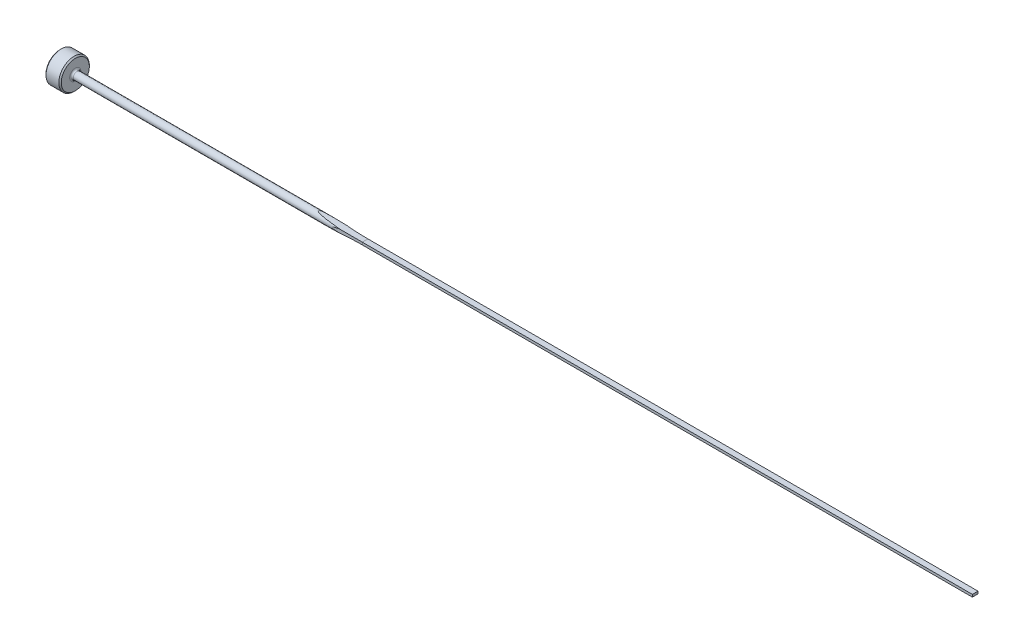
ISO-10303-21;
HEADER;
FILE_DESCRIPTION(('STEP AP214'),'2;1');
FILE_NAME('part.step','',(''),(''),'','','');
FILE_SCHEMA(('AUTOMOTIVE_DESIGN { 1 0 10303 214 1 1 1 1 }'));
ENDSEC;
DATA;
#1=APPLICATION_CONTEXT('core data for automotive mechanical design processes');
#2=APPLICATION_PROTOCOL_DEFINITION('international standard','automotive_design',2000,#1);
#3=PRODUCT_CONTEXT('',#1,'mechanical');
#4=PRODUCT('Part','Part','',(#3));
#5=PRODUCT_RELATED_PRODUCT_CATEGORY('part','',(#4));
#6=PRODUCT_DEFINITION_FORMATION('','',#4);
#7=PRODUCT_DEFINITION_CONTEXT('part definition',#1,'design');
#8=PRODUCT_DEFINITION('design','',#6,#7);
#9=PRODUCT_DEFINITION_SHAPE('','',#8);
#10=(LENGTH_UNIT() NAMED_UNIT(*) SI_UNIT(.MILLI.,.METRE.));
#11=(NAMED_UNIT(*) PLANE_ANGLE_UNIT() SI_UNIT($,.RADIAN.));
#12=(NAMED_UNIT(*) SI_UNIT($,.STERADIAN.) SOLID_ANGLE_UNIT());
#13=UNCERTAINTY_MEASURE_WITH_UNIT(LENGTH_MEASURE(1.E-05),#10,'distance_accuracy_value','');
#14=(GEOMETRIC_REPRESENTATION_CONTEXT(3) GLOBAL_UNCERTAINTY_ASSIGNED_CONTEXT((#13)) GLOBAL_UNIT_ASSIGNED_CONTEXT((#10,
#11,#12)) REPRESENTATION_CONTEXT('',''));
#15=CARTESIAN_POINT('',(0.,0.,0.));
#16=DIRECTION('',(0.,0.,1.));
#17=DIRECTION('',(1.,0.,0.));
#18=AXIS2_PLACEMENT_3D('',#15,#16,#17);
#19=CARTESIAN_POINT('',(0.,0.,0.));
#20=DIRECTION('',(-1.,0.,0.));
#21=DIRECTION('',(0.,0.,1.));
#22=AXIS2_PLACEMENT_3D('',#19,#20,#21);
#23=CYLINDRICAL_SURFACE('',#22,0.79375);
#24=CARTESIAN_POINT('',(3.556,0.,0.));
#25=DIRECTION('',(-1.,0.,0.));
#26=DIRECTION('',(0.,0.,1.));
#27=AXIS2_PLACEMENT_3D('',#24,#25,#26);
#28=CIRCLE('',#27,0.79375);
#29=CARTESIAN_POINT('',(3.556,0.,0.79375));
#30=VERTEX_POINT('',#29);
#31=EDGE_CURVE('E152',#30,#30,#28,.F.);
#32=ORIENTED_EDGE('',*,*,#31,.T.);
#33=EDGE_LOOP('',(#32));
#34=FACE_BOUND('',#33,.T.);
#35=CARTESIAN_POINT('',(63.5,0.537354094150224,0.584199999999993));
#36=CARTESIAN_POINT('',(63.3677986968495,0.537352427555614,0.584199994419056));
#37=CARTESIAN_POINT('',(63.2355977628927,0.537033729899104,0.584494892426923));
#38=CARTESIAN_POINT('',(62.9711986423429,0.535747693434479,0.585674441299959));
#39=CARTESIAN_POINT('',(62.8390004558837,0.534780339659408,0.586559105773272));
#40=CARTESIAN_POINT('',(62.4420069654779,0.53087936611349,0.590101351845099));
#41=CARTESIAN_POINT('',(62.1772280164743,0.526946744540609,0.593647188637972));
#42=CARTESIAN_POINT('',(61.6475584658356,0.516094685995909,0.603107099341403));
#43=CARTESIAN_POINT('',(61.3826679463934,0.509172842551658,0.609023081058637));
#44=CARTESIAN_POINT('',(60.8530338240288,0.491693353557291,0.623220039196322));
#45=CARTESIAN_POINT('',(60.58829024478,0.481135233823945,0.631501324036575));
#46=CARTESIAN_POINT('',(60.0594832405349,0.455276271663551,0.650407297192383));
#47=CARTESIAN_POINT('',(59.7954193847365,0.439982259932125,0.661028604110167));
#48=CARTESIAN_POINT('',(59.39981069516,0.411723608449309,0.678705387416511));
#49=CARTESIAN_POINT('',(59.2680369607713,0.401419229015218,0.684887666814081));
#50=CARTESIAN_POINT('',(59.004722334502,0.378486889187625,0.697828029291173));
#51=CARTESIAN_POINT('',(58.8731814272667,0.36585908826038,0.704586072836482));
#52=CARTESIAN_POINT('',(58.6761769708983,0.344482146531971,0.715145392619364));
#53=CARTESIAN_POINT('',(58.6105699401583,0.33695195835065,0.71873496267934));
#54=CARTESIAN_POINT('',(58.4794798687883,0.320881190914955,0.726052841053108));
#55=CARTESIAN_POINT('',(58.4139968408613,0.312340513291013,0.729781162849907));
#56=CARTESIAN_POINT('',(58.2830735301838,0.293954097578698,0.737380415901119));
#57=CARTESIAN_POINT('',(58.2176336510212,0.284105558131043,0.741251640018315));
#58=CARTESIAN_POINT('',(58.0870608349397,0.262655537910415,0.749120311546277));
#59=CARTESIAN_POINT('',(58.0219278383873,0.25105441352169,0.753117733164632));
#60=CARTESIAN_POINT('',(57.8919403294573,0.22526665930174,0.761238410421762));
#61=CARTESIAN_POINT('',(57.8270873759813,0.211071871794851,0.765362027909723));
#62=CARTESIAN_POINT('',(57.7307839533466,0.1864338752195,0.771589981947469));
#63=CARTESIAN_POINT('',(57.6989102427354,0.177685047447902,0.773668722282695));
#64=CARTESIAN_POINT('',(57.6356848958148,0.158500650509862,0.777825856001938));
#65=CARTESIAN_POINT('',(57.6043331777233,0.14806534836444,0.779904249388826));
#66=CARTESIAN_POINT('',(57.5449685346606,0.12536357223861,0.783870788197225));
#67=CARTESIAN_POINT('',(57.5168860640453,0.113303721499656,0.785761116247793));
#68=CARTESIAN_POINT('',(57.4787827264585,0.0926836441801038,0.788342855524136));
#69=CARTESIAN_POINT('',(57.4676987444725,0.0861257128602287,0.789096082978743));
#70=CARTESIAN_POINT('',(57.4464596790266,0.0716589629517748,0.790543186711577));
#71=CARTESIAN_POINT('',(57.4362989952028,0.0637592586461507,0.791237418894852));
#72=CARTESIAN_POINT('',(57.4241935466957,0.0517558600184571,0.792066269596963));
#73=CARTESIAN_POINT('',(57.4212914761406,0.0486376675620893,0.792265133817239));
#74=CARTESIAN_POINT('',(57.4158307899,0.0421001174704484,0.792639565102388));
#75=CARTESIAN_POINT('',(57.4132726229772,0.0386803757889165,0.792815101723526));
#76=CARTESIAN_POINT('',(57.4086203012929,0.0314630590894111,0.793134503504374));
#77=CARTESIAN_POINT('',(57.4065328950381,0.0276609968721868,0.793277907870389));
#78=CARTESIAN_POINT('',(57.4030925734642,0.0197374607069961,0.793514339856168));
#79=CARTESIAN_POINT('',(57.4017370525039,0.0156171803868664,0.793607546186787));
#80=CARTESIAN_POINT('',(57.4002141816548,0.00832744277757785,0.793712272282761));
#81=CARTESIAN_POINT('',(57.3998236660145,0.00520497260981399,0.793739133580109));
#82=CARTESIAN_POINT('',(57.3995863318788,-0.0010609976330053,0.793755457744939));
#83=CARTESIAN_POINT('',(57.3997393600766,-0.00420449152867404,0.793744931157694));
#84=CARTESIAN_POINT('',(57.4005699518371,-0.0104090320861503,0.793687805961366));
#85=CARTESIAN_POINT('',(57.4012458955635,-0.013470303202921,0.793641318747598));
#86=CARTESIAN_POINT('',(57.4030509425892,-0.0194544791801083,0.793517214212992));
#87=CARTESIAN_POINT('',(57.4041804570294,-0.0223772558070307,0.79343956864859));
#88=CARTESIAN_POINT('',(57.4075834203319,-0.0297362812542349,0.793205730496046));
#89=CARTESIAN_POINT('',(57.410137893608,-0.0340408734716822,0.793030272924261));
#90=CARTESIAN_POINT('',(57.4158647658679,-0.0422141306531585,0.792637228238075));
#91=CARTESIAN_POINT('',(57.4190391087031,-0.0460813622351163,0.792419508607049));
#92=CARTESIAN_POINT('',(57.4306425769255,-0.0587562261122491,0.791624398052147));
#93=CARTESIAN_POINT('',(57.4400482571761,-0.0666461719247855,0.790981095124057));
#94=CARTESIAN_POINT('',(57.4598384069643,-0.0810740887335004,0.78963111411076));
#95=CARTESIAN_POINT('',(57.470228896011,-0.0876028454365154,0.788924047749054));
#96=CARTESIAN_POINT('',(57.5002052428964,-0.104735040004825,0.786889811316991));
#97=CARTESIAN_POINT('',(57.5203710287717,-0.114312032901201,0.785527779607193));
#98=CARTESIAN_POINT('',(57.5614041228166,-0.131848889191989,0.782770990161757));
#99=CARTESIAN_POINT('',(57.5822732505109,-0.13980411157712,0.78137615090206));
#100=CARTESIAN_POINT('',(57.6454933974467,-0.162091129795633,0.777173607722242));
#101=CARTESIAN_POINT('',(57.688404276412,-0.17481938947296,0.774351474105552));
#102=CARTESIAN_POINT('',(57.8170052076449,-0.20942402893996,0.765989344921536));
#103=CARTESIAN_POINT('',(57.9035078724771,-0.228079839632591,0.760489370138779));
#104=CARTESIAN_POINT('',(58.0773949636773,-0.261317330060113,0.749691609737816));
#105=CARTESIAN_POINT('',(58.1647806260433,-0.275892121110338,0.744394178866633));
#106=CARTESIAN_POINT('',(58.3398406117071,-0.302364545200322,0.734042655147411));
#107=CARTESIAN_POINT('',(58.4275143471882,-0.314265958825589,0.728988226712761));
#108=CARTESIAN_POINT('',(58.6030327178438,-0.336200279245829,0.719131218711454));
#109=CARTESIAN_POINT('',(58.6908771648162,-0.346234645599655,0.714328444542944));
#110=CARTESIAN_POINT('',(58.9696341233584,-0.375842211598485,0.699503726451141));
#111=CARTESIAN_POINT('',(59.1608447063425,-0.392834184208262,0.689952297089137));
#112=CARTESIAN_POINT('',(59.5436524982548,-0.422669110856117,0.672072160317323));
#113=CARTESIAN_POINT('',(59.7352497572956,-0.435511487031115,0.663743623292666));
#114=CARTESIAN_POINT('',(60.118807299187,-0.458164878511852,0.648315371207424));
#115=CARTESIAN_POINT('',(60.3107677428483,-0.467973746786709,0.641216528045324));
#116=CARTESIAN_POINT('',(60.6948219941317,-0.485222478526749,0.628261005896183));
#117=CARTESIAN_POINT('',(60.8869157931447,-0.492662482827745,0.622404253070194));
#118=CARTESIAN_POINT('',(61.4633489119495,-0.512094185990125,0.60670099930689));
#119=CARTESIAN_POINT('',(61.847838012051,-0.521197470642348,0.59872158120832));
#120=CARTESIAN_POINT('',(62.6168658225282,-0.53352023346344,0.587755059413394));
#121=CARTESIAN_POINT('',(63.0014044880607,-0.536741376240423,0.584766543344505));
#122=CARTESIAN_POINT('',(63.4239617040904,-0.537327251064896,0.584224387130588));
#123=CARTESIAN_POINT('',(63.4619808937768,-0.537353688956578,0.584199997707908));
#124=CARTESIAN_POINT('',(63.5,-0.537354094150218,0.584199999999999));
#125=B_SPLINE_CURVE_WITH_KNOTS('',3,(#35,#36,#37,#38,#39,#40,#41,#42,#43,#44,#45,#46,#47,#48,
#49,#50,#51,#52,#53,#54,#55,#56,#57,#58,#59,#60,#61,#62,#63,#64,#65,#66,#67,#68,#69,#70,#71,#72,
#73,#74,#75,#76,#77,#78,#79,#80,#81,#82,#83,#84,#85,#86,#87,#88,#89,#90,#91,#92,#93,#94,#95,#96,
#97,#98,#99,#100,#101,#102,#103,#104,#105,#106,#107,#108,#109,#110,#111,#112,#113,#114,#115,
#116,#117,#118,#119,#120,#121,#122,#123,#124),.UNSPECIFIED.,.F.,.F.,(4,2,2,2,2,2,2,2,2,2,2,2,2,
2,2,2,2,2,2,2,2,2,2,2,2,2,2,2,2,2,2,2,2,2,2,2,2,2,2,2,2,2,2,2,4),(0.,0.396602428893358,
0.793214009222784,1.58768292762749,2.38279262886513,3.1780060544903,3.97207782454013,
4.36902531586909,4.76594557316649,4.96434526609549,5.16276428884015,5.36161538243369,
5.56042609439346,5.7598732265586,5.85918782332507,5.95848671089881,6.05003157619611,
6.08869793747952,6.12711144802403,6.13988635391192,6.15267777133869,6.16564230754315,
6.17856037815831,6.18795697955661,6.19735093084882,6.20671589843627,6.21608937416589,
6.23102781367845,6.24601387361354,6.28261070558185,6.3194477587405,6.38636719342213,
6.45347552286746,6.58786698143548,6.85363398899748,7.11984693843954,7.38568101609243,
7.65130639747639,8.22782048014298,8.80441481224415,9.38141631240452,9.95838350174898,
11.1123237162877,12.2659373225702,12.37999486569),.UNSPECIFIED.);
#126=CARTESIAN_POINT('',(58.9340135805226,0.371334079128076,0.701534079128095));
#127=VERTEX_POINT('',#126);
#128=CARTESIAN_POINT('',(58.9340135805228,-0.37133407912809,0.701534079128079));
#129=VERTEX_POINT('',#128);
#130=EDGE_CURVE('E155',#127,#129,#125,.T.);
#131=ORIENTED_EDGE('',*,*,#130,.F.);
#132=CARTESIAN_POINT('',(63.5,0.25399999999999,0.752012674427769));
#133=CARTESIAN_POINT('',(63.3676051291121,0.253999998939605,0.752011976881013));
#134=CARTESIAN_POINT('',(63.2352103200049,0.254295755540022,0.751912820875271));
#135=CARTESIAN_POINT('',(62.9704151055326,0.2554788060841,0.751511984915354));
#136=CARTESIAN_POINT('',(62.838014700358,0.256366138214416,0.751210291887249));
#137=CARTESIAN_POINT('',(62.573418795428,0.258730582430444,0.750399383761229));
#138=CARTESIAN_POINT('',(62.4412232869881,0.260206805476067,0.749890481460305));
#139=CARTESIAN_POINT('',(62.1768502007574,0.263748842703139,0.748651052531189));
#140=CARTESIAN_POINT('',(62.0446726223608,0.265814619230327,0.747920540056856));
#141=CARTESIAN_POINT('',(61.3840325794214,0.277613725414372,0.743694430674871));
#142=CARTESIAN_POINT('',(60.8556443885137,0.291765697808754,0.738475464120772));
#143=CARTESIAN_POINT('',(60.0632580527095,0.320061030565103,0.726428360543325));
#144=CARTESIAN_POINT('',(59.7990945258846,0.330674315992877,0.721707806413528));
#145=CARTESIAN_POINT('',(59.2709150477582,0.354254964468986,0.710433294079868));
#146=CARTESIAN_POINT('',(59.00689909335,0.367222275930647,0.703879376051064));
#147=CARTESIAN_POINT('',(58.4775902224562,0.395586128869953,0.688341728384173));
#148=CARTESIAN_POINT('',(58.2122983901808,0.410995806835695,0.679344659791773));
#149=CARTESIAN_POINT('',(57.6819676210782,0.444186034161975,0.658123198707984));
#150=CARTESIAN_POINT('',(57.4169287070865,0.461966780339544,0.645898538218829));
#151=CARTESIAN_POINT('',(56.8876122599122,0.499859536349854,0.617052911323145));
#152=CARTESIAN_POINT('',(56.6233341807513,0.51996829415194,0.600438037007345));
#153=CARTESIAN_POINT('',(56.2274397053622,0.551870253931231,0.570688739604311));
#154=CARTESIAN_POINT('',(56.0955722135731,0.562793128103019,0.559968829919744));
#155=CARTESIAN_POINT('',(55.8320684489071,0.58521143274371,0.536499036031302));
#156=CARTESIAN_POINT('',(55.7004321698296,0.596706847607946,0.523749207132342));
#157=CARTESIAN_POINT('',(55.4368193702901,0.620318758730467,0.495566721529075));
#158=CARTESIAN_POINT('',(55.3048444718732,0.632438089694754,0.480120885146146));
#159=CARTESIAN_POINT('',(55.1071267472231,0.651039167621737,0.454201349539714));
#160=CARTESIAN_POINT('',(55.0411860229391,0.657317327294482,0.445090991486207));
#161=CARTESIAN_POINT('',(54.9094902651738,0.67000417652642,0.42575565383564));
#162=CARTESIAN_POINT('',(54.8437352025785,0.676412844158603,0.415530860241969));
#163=CARTESIAN_POINT('',(54.7130519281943,0.689296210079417,0.393786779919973));
#164=CARTESIAN_POINT('',(54.6481215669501,0.695769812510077,0.382279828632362));
#165=CARTESIAN_POINT('',(54.5185612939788,0.708830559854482,0.357486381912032));
#166=CARTESIAN_POINT('',(54.4539315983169,0.715417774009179,0.344198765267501));
#167=CARTESIAN_POINT('',(54.3254630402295,0.728652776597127,0.315207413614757));
#168=CARTESIAN_POINT('',(54.2616222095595,0.735300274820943,0.299512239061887));
#169=CARTESIAN_POINT('',(54.1349588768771,0.748626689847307,0.264506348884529));
#170=CARTESIAN_POINT('',(54.0721350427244,0.755305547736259,0.245200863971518));
#171=CARTESIAN_POINT('',(53.9795365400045,0.765246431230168,0.211119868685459));
#172=CARTESIAN_POINT('',(53.9488466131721,0.768557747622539,0.198857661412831));
#173=CARTESIAN_POINT('',(53.888524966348,0.775097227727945,0.171663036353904));
#174=CARTESIAN_POINT('',(53.8588943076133,0.778325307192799,0.156728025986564));
#175=CARTESIAN_POINT('',(53.8164729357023,0.782966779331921,0.130682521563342));
#176=CARTESIAN_POINT('',(53.8026168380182,0.78448636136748,0.121347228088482));
#177=CARTESIAN_POINT('',(53.7762873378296,0.787379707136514,0.100898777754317));
#178=CARTESIAN_POINT('',(53.7638057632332,0.788754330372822,0.0897972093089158));
#179=CARTESIAN_POINT('',(53.7485814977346,0.790433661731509,0.0726332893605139));
#180=CARTESIAN_POINT('',(53.7445925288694,0.790873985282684,0.0677047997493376));
#181=CARTESIAN_POINT('',(53.7372134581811,0.791688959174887,0.0573982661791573));
#182=CARTESIAN_POINT('',(53.7338238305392,0.792063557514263,0.0520198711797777));
#183=CARTESIAN_POINT('',(53.7278410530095,0.792725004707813,0.0407242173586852));
#184=CARTESIAN_POINT('',(53.7252594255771,0.793010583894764,0.0348005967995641));
#185=CARTESIAN_POINT('',(53.7212660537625,0.793452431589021,0.0225697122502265));
#186=CARTESIAN_POINT('',(53.7198508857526,0.793609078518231,0.016263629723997));
#187=CARTESIAN_POINT('',(53.7184842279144,0.793760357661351,0.00410558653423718));
#188=CARTESIAN_POINT('',(53.7184046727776,0.793769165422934,-0.00173147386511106));
#189=CARTESIAN_POINT('',(53.7193945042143,0.793659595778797,-0.0133077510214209));
#190=CARTESIAN_POINT('',(53.7204649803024,0.793541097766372,-0.0190468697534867));
#191=CARTESIAN_POINT('',(53.723760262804,0.793176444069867,-0.0307931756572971));
#192=CARTESIAN_POINT('',(53.7260898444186,0.792918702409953,-0.0367697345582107));
#193=CARTESIAN_POINT('',(53.7316667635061,0.792301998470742,-0.0482689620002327));
#194=CARTESIAN_POINT('',(53.7349158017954,0.791942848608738,-0.0537907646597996));
#195=CARTESIAN_POINT('',(53.7445660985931,0.790876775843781,-0.0680801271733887));
#196=CARTESIAN_POINT('',(53.7515837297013,0.790102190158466,-0.0764199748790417));
#197=CARTESIAN_POINT('',(53.7667021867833,0.788435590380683,-0.0920279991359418));
#198=CARTESIAN_POINT('',(53.7748063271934,0.787543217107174,-0.0992927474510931));
#199=CARTESIAN_POINT('',(53.8088868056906,0.783795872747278,-0.127130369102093));
#200=CARTESIAN_POINT('',(53.8374241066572,0.780669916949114,-0.144433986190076));
#201=CARTESIAN_POINT('',(53.8963167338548,0.774250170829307,-0.175534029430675));
#202=CARTESIAN_POINT('',(53.9266837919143,0.770955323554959,-0.189303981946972));
#203=CARTESIAN_POINT('',(53.9923477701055,0.763866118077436,-0.216260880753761));
#204=CARTESIAN_POINT('',(54.0277729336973,0.760062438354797,-0.22914011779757));
#205=CARTESIAN_POINT('',(54.0992439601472,0.752432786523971,-0.2530573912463));
#206=CARTESIAN_POINT('',(54.1352903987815,0.74860679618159,-0.264093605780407));
#207=CARTESIAN_POINT('',(54.2441530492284,0.737120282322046,-0.295283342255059));
#208=CARTESIAN_POINT('',(54.3175352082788,0.729468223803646,-0.313460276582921));
#209=CARTESIAN_POINT('',(54.4650249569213,0.714276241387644,-0.346659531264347));
#210=CARTESIAN_POINT('',(54.5391329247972,0.706736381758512,-0.361680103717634));
#211=CARTESIAN_POINT('',(54.6876663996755,0.691814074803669,-0.389460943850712));
#212=CARTESIAN_POINT('',(54.7620912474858,0.684431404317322,-0.402224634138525));
#213=CARTESIAN_POINT('',(54.9844193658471,0.662661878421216,-0.4378304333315));
#214=CARTESIAN_POINT('',(55.1327270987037,0.648514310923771,-0.458264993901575));
#215=CARTESIAN_POINT('',(55.4299306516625,0.620919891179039,-0.49498893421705));
#216=CARTESIAN_POINT('',(55.5788265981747,0.607473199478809,-0.511277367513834));
#217=CARTESIAN_POINT('',(55.8771600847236,0.581291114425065,-0.540861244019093));
#218=CARTESIAN_POINT('',(56.0265980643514,0.568556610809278,-0.554153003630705));
#219=CARTESIAN_POINT('',(56.3257039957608,0.543831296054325,-0.578432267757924));
#220=CARTESIAN_POINT('',(56.475371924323,0.531840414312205,-0.589419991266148));
#221=CARTESIAN_POINT('',(56.9242321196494,0.497024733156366,-0.619645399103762));
#222=CARTESIAN_POINT('',(57.2236931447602,0.475320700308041,-0.63618312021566));
#223=CARTESIAN_POINT('',(57.8228688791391,0.434947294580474,-0.664419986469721));
#224=CARTESIAN_POINT('',(58.1225833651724,0.416276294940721,-0.676121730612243));
#225=CARTESIAN_POINT('',(58.8407487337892,0.375191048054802,-0.700033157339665));
#226=CARTESIAN_POINT('',(59.2593356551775,0.354211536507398,-0.710617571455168));
#227=CARTESIAN_POINT('',(60.096920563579,0.318169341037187,-0.727457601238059));
#228=CARTESIAN_POINT('',(60.5159186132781,0.303107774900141,-0.733712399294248));
#229=CARTESIAN_POINT('',(61.3540408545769,0.278915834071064,-0.743245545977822));
#230=CARTESIAN_POINT('',(61.7731650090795,0.269784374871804,-0.746524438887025));
#231=CARTESIAN_POINT('',(62.6115101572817,0.257451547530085,-0.750866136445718));
#232=CARTESIAN_POINT('',(63.030731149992,0.254250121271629,-0.751928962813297));
#233=CARTESIAN_POINT('',(63.4666318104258,0.254004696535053,-0.752011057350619));
#234=CARTESIAN_POINT('',(63.4833159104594,0.253999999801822,-0.752012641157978));
#235=CARTESIAN_POINT('',(63.5,0.25399999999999,-0.752012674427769));
#236=B_SPLINE_CURVE_WITH_KNOTS('',3,(#132,#133,#134,#135,#136,#137,#138,#139,#140,#141,#142,
#143,#144,#145,#146,#147,#148,#149,#150,#151,#152,#153,#154,#155,#156,#157,#158,#159,#160,#161,
#162,#163,#164,#165,#166,#167,#168,#169,#170,#171,#172,#173,#174,#175,#176,#177,#178,#179,#180,
#181,#182,#183,#184,#185,#186,#187,#188,#189,#190,#191,#192,#193,#194,#195,#196,#197,#198,#199,
#200,#201,#202,#203,#204,#205,#206,#207,#208,#209,#210,#211,#212,#213,#214,#215,#216,#217,#218,
#219,#220,#221,#222,#223,#224,#225,#226,#227,#228,#229,#230,#231,#232,#233,#234,#235),
.UNSPECIFIED.,.F.,.F.,(4,2,2,2,2,2,2,2,2,2,2,2,2,2,2,2,2,2,2,2,2,2,2,2,2,2,2,2,2,2,2,2,2,2,2,2,
2,2,2,2,2,2,2,2,2,2,2,2,2,2,2,4),(0.,0.397184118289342,0.794393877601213,1.19100623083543,
1.58759325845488,3.17327204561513,3.96651651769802,4.7597436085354,5.55739174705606,
6.3551061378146,7.1517193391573,7.54996405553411,7.94819792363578,8.34843609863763,
8.54901641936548,8.74956331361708,8.94832472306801,9.14721187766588,9.34540758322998,
9.54331833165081,9.64292048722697,9.74261978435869,9.79288720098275,9.84283747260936,
9.86187168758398,9.88092089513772,9.90023053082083,9.91948328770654,9.93687817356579,
9.9542895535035,9.97344294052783,9.99263199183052,10.0252279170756,10.0579256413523,
10.1576949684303,10.2581912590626,10.3717328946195,10.4853861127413,10.7131966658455,
10.941133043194,11.1687207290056,11.6197421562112,12.0708664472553,12.5225422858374,
12.9741751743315,13.87619441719,14.7777282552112,16.0353823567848,17.2932738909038,
18.5509353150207,19.8085844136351,19.8586367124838),.UNSPECIFIED.);
#237=CARTESIAN_POINT('',(58.9340135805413,0.371334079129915,-0.701534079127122));
#238=VERTEX_POINT('',#237);
#239=EDGE_CURVE('E105',#127,#238,#236,.T.);
#240=ORIENTED_EDGE('',*,*,#239,.T.);
#241=CARTESIAN_POINT('',(63.5,0.537354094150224,-0.584199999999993));
#242=CARTESIAN_POINT('',(63.3677986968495,0.537352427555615,-0.584199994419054));
#243=CARTESIAN_POINT('',(63.2355977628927,0.537033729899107,-0.584494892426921));
#244=CARTESIAN_POINT('',(62.9711986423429,0.535747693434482,-0.585674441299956));
#245=CARTESIAN_POINT('',(62.8390004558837,0.534780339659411,-0.586559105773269));
#246=CARTESIAN_POINT('',(62.4420069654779,0.530879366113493,-0.590101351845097));
#247=CARTESIAN_POINT('',(62.1772280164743,0.526946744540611,-0.593647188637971));
#248=CARTESIAN_POINT('',(61.6475584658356,0.516094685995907,-0.603107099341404));
#249=CARTESIAN_POINT('',(61.3826679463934,0.509172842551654,-0.60902308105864));
#250=CARTESIAN_POINT('',(60.8530338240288,0.491693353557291,-0.623220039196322));
#251=CARTESIAN_POINT('',(60.58829024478,0.481135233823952,-0.63150132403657));
#252=CARTESIAN_POINT('',(60.0594832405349,0.455276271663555,-0.65040729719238));
#253=CARTESIAN_POINT('',(59.7954193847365,0.439982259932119,-0.66102860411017));
#254=CARTESIAN_POINT('',(59.39981069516,0.411723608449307,-0.678705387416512));
#255=CARTESIAN_POINT('',(59.2680369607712,0.401419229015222,-0.684887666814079));
#256=CARTESIAN_POINT('',(59.0047223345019,0.378486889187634,-0.697828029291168));
#257=CARTESIAN_POINT('',(58.8731814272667,0.36585908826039,-0.704586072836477));
#258=CARTESIAN_POINT('',(58.6761769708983,0.344482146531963,-0.715145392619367));
#259=CARTESIAN_POINT('',(58.6105699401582,0.336951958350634,-0.718734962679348));
#260=CARTESIAN_POINT('',(58.4794798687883,0.320881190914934,-0.726052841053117));
#261=CARTESIAN_POINT('',(58.4139968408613,0.312340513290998,-0.729781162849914));
#262=CARTESIAN_POINT('',(58.2830735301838,0.293954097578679,-0.737380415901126));
#263=CARTESIAN_POINT('',(58.2176336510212,0.284105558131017,-0.741251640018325));
#264=CARTESIAN_POINT('',(58.0870608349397,0.262655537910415,-0.749120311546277));
#265=CARTESIAN_POINT('',(58.0219278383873,0.251054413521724,-0.753117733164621));
#266=CARTESIAN_POINT('',(57.8919403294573,0.225266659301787,-0.761238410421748));
#267=CARTESIAN_POINT('',(57.8270873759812,0.211071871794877,-0.765362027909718));
#268=CARTESIAN_POINT('',(57.7307839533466,0.18643387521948,-0.771589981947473));
#269=CARTESIAN_POINT('',(57.6989102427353,0.177685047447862,-0.773668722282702));
#270=CARTESIAN_POINT('',(57.6356848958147,0.158500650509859,-0.77782585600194));
#271=CARTESIAN_POINT('',(57.6043331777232,0.148065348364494,-0.779904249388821));
#272=CARTESIAN_POINT('',(57.5449685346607,0.125363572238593,-0.783870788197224));
#273=CARTESIAN_POINT('',(57.5168860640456,0.113303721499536,-0.785761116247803));
#274=CARTESIAN_POINT('',(57.4787827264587,0.0926836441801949,-0.788342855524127));
#275=CARTESIAN_POINT('',(57.4676987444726,0.0861257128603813,-0.789096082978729));
#276=CARTESIAN_POINT('',(57.4464596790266,0.0716589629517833,-0.790543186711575));
#277=CARTESIAN_POINT('',(57.4362989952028,0.0637592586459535,-0.791237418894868));
#278=CARTESIAN_POINT('',(57.4241935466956,0.0517558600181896,-0.792066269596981));
#279=CARTESIAN_POINT('',(57.4212914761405,0.0486376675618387,-0.792265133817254));
#280=CARTESIAN_POINT('',(57.4158307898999,0.0421001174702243,-0.7926395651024));
#281=CARTESIAN_POINT('',(57.4132726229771,0.0386803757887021,-0.792815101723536));
#282=CARTESIAN_POINT('',(57.4086203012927,0.0314630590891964,-0.793134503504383));
#283=CARTESIAN_POINT('',(57.406532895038,0.0276609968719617,-0.793277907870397));
#284=CARTESIAN_POINT('',(57.4030925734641,0.0197374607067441,-0.793514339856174));
#285=CARTESIAN_POINT('',(57.4017370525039,0.0156171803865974,-0.793607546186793));
#286=CARTESIAN_POINT('',(57.4002141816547,0.00832744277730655,-0.793712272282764));
#287=CARTESIAN_POINT('',(57.3998236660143,0.00520497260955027,-0.793739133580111));
#288=CARTESIAN_POINT('',(57.3995863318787,-0.00106099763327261,-0.793755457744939));
#289=CARTESIAN_POINT('',(57.3997393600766,-0.00420449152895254,-0.793744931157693));
#290=CARTESIAN_POINT('',(57.4005699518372,-0.0104090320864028,-0.793687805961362));
#291=CARTESIAN_POINT('',(57.4012458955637,-0.0134703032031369,-0.793641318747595));
#292=CARTESIAN_POINT('',(57.4030509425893,-0.0194544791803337,-0.793517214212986));
#293=CARTESIAN_POINT('',(57.4041804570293,-0.0223772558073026,-0.793439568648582));
#294=CARTESIAN_POINT('',(57.4075834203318,-0.0297362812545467,-0.793205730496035));
#295=CARTESIAN_POINT('',(57.4101378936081,-0.0340408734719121,-0.793030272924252));
#296=CARTESIAN_POINT('',(57.4158647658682,-0.0422141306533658,-0.792637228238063));
#297=CARTESIAN_POINT('',(57.4190391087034,-0.0460813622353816,-0.792419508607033));
#298=CARTESIAN_POINT('',(57.4306425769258,-0.0587562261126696,-0.791624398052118));
#299=CARTESIAN_POINT('',(57.4400482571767,-0.0666461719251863,-0.790981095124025));
#300=CARTESIAN_POINT('',(57.4598384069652,-0.0810740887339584,-0.789631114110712));
#301=CARTESIAN_POINT('',(57.4702288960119,-0.0876028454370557,-0.788924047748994));
#302=CARTESIAN_POINT('',(57.5002052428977,-0.104735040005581,-0.786889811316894));
#303=CARTESIAN_POINT('',(57.5203710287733,-0.114312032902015,-0.785527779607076));
#304=CARTESIAN_POINT('',(57.5614041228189,-0.131848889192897,-0.782770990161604));
#305=CARTESIAN_POINT('',(57.5822732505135,-0.139804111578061,-0.781376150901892));
#306=CARTESIAN_POINT('',(57.6454933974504,-0.162091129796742,-0.777173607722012));
#307=CARTESIAN_POINT('',(57.6884042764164,-0.174819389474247,-0.774351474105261));
#308=CARTESIAN_POINT('',(57.8170052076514,-0.209424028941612,-0.765989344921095));
#309=CARTESIAN_POINT('',(57.903507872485,-0.228079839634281,-0.760489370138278));
#310=CARTESIAN_POINT('',(58.077394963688,-0.261317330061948,-0.749691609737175));
#311=CARTESIAN_POINT('',(58.1647806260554,-0.275892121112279,-0.744394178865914));
#312=CARTESIAN_POINT('',(58.3398406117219,-0.302364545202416,-0.734042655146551));
#313=CARTESIAN_POINT('',(58.4275143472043,-0.314265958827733,-0.728988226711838));
#314=CARTESIAN_POINT('',(58.6030327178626,-0.336200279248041,-0.719131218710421));
#315=CARTESIAN_POINT('',(58.6908771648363,-0.346234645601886,-0.714328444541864));
#316=CARTESIAN_POINT('',(58.969634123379,-0.375842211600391,-0.699503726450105));
#317=CARTESIAN_POINT('',(59.1608447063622,-0.392834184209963,-0.689952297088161));
#318=CARTESIAN_POINT('',(59.5436524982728,-0.422669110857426,-0.672072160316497));
#319=CARTESIAN_POINT('',(59.7352497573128,-0.435511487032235,-0.663743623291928));
#320=CARTESIAN_POINT('',(60.1188072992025,-0.458164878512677,-0.648315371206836));
#321=CARTESIAN_POINT('',(60.310767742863,-0.467973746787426,-0.641216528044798));
#322=CARTESIAN_POINT('',(60.6948219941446,-0.485222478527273,-0.628261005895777));
#323=CARTESIAN_POINT('',(60.8869157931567,-0.492662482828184,-0.622404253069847));
#324=CARTESIAN_POINT('',(61.463348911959,-0.512094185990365,-0.606700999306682));
#325=CARTESIAN_POINT('',(61.8478380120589,-0.521197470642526,-0.598721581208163));
#326=CARTESIAN_POINT('',(62.6168658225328,-0.533520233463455,-0.58775505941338));
#327=CARTESIAN_POINT('',(63.0014044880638,-0.536741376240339,-0.584766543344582));
#328=CARTESIAN_POINT('',(63.4239617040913,-0.53732725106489,-0.584224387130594));
#329=CARTESIAN_POINT('',(63.4619808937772,-0.53735368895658,-0.584199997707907));
#330=CARTESIAN_POINT('',(63.5,-0.537354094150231,-0.584199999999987));
#331=B_SPLINE_CURVE_WITH_KNOTS('',3,(#241,#242,#243,#244,#245,#246,#247,#248,#249,#250,#251,
#252,#253,#254,#255,#256,#257,#258,#259,#260,#261,#262,#263,#264,#265,#266,#267,#268,#269,#270,
#271,#272,#273,#274,#275,#276,#277,#278,#279,#280,#281,#282,#283,#284,#285,#286,#287,#288,#289,
#290,#291,#292,#293,#294,#295,#296,#297,#298,#299,#300,#301,#302,#303,#304,#305,#306,#307,#308,
#309,#310,#311,#312,#313,#314,#315,#316,#317,#318,#319,#320,#321,#322,#323,#324,#325,#326,#327,
#328,#329,#330),.UNSPECIFIED.,.F.,.F.,(4,2,2,2,2,2,2,2,2,2,2,2,2,2,2,2,2,2,2,2,2,2,2,2,2,2,2,2,
2,2,2,2,2,2,2,2,2,2,2,2,2,2,2,2,4),(0.,0.396602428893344,0.793214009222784,1.58768292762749,
2.38279262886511,3.17800605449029,3.97207782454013,4.36902531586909,4.76594557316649,
4.96434526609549,5.16276428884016,5.3616153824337,5.56042609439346,5.75987322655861,
5.8591878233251,5.95848671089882,6.05003157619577,6.08869793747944,6.12711144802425,
6.13988635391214,6.15267777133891,6.16564230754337,6.17856037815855,6.18795697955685,
6.19735093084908,6.20671589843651,6.21608937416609,6.23102781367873,6.24601387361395,
6.2826107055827,6.31944775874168,6.38636719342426,6.45347552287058,6.58786698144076,
6.85363398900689,7.11984693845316,7.38568101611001,7.65130639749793,8.22782048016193,
8.8044148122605,9.38141631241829,9.95838350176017,11.1123237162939,12.2659373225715,
12.37999486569),.UNSPECIFIED.);
#332=CARTESIAN_POINT('',(58.9340135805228,-0.37133407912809,-0.701534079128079));
#333=VERTEX_POINT('',#332);
#334=EDGE_CURVE('E174',#238,#333,#331,.T.);
#335=ORIENTED_EDGE('',*,*,#334,.T.);
#336=CARTESIAN_POINT('',(63.5,-0.25399999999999,0.752012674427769));
#337=CARTESIAN_POINT('',(63.3676051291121,-0.253999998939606,0.752011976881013));
#338=CARTESIAN_POINT('',(63.2352103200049,-0.254295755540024,0.751912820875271));
#339=CARTESIAN_POINT('',(62.9704151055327,-0.255478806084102,0.751511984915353));
#340=CARTESIAN_POINT('',(62.838014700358,-0.256366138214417,0.751210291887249));
#341=CARTESIAN_POINT('',(62.5734187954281,-0.258730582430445,0.750399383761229));
#342=CARTESIAN_POINT('',(62.4412232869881,-0.260206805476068,0.749890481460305));
#343=CARTESIAN_POINT('',(62.1768502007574,-0.263748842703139,0.748651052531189));
#344=CARTESIAN_POINT('',(62.0446726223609,-0.265814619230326,0.747920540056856));
#345=CARTESIAN_POINT('',(61.3840325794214,-0.277613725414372,0.743694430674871));
#346=CARTESIAN_POINT('',(60.8556443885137,-0.291765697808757,0.73847546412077));
#347=CARTESIAN_POINT('',(60.0632580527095,-0.320061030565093,0.72642836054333));
#348=CARTESIAN_POINT('',(59.7990945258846,-0.330674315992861,0.721707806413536));
#349=CARTESIAN_POINT('',(59.2709150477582,-0.354254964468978,0.710433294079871));
#350=CARTESIAN_POINT('',(59.00689909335,-0.367222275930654,0.703879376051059));
#351=CARTESIAN_POINT('',(58.4775902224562,-0.395586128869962,0.688341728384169));
#352=CARTESIAN_POINT('',(58.2122983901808,-0.41099580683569,0.679344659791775));
#353=CARTESIAN_POINT('',(57.6819676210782,-0.444186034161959,0.658123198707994));
#354=CARTESIAN_POINT('',(57.4169287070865,-0.461966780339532,0.645898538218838));
#355=CARTESIAN_POINT('',(56.8876122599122,-0.499859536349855,0.617052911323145));
#356=CARTESIAN_POINT('',(56.6233341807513,-0.51996829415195,0.600438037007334));
#357=CARTESIAN_POINT('',(56.2274397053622,-0.551870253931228,0.570688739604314));
#358=CARTESIAN_POINT('',(56.0955722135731,-0.562793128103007,0.559968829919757));
#359=CARTESIAN_POINT('',(55.8320684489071,-0.585211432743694,0.536499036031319));
#360=CARTESIAN_POINT('',(55.7004321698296,-0.596706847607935,0.523749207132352));
#361=CARTESIAN_POINT('',(55.4368193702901,-0.620318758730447,0.495566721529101));
#362=CARTESIAN_POINT('',(55.3048444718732,-0.632438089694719,0.480120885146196));
#363=CARTESIAN_POINT('',(55.1071267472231,-0.65103916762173,0.454201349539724));
#364=CARTESIAN_POINT('',(55.0411860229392,-0.657317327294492,0.445090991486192));
#365=CARTESIAN_POINT('',(54.9094902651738,-0.670004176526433,0.42575565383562));
#366=CARTESIAN_POINT('',(54.8437352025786,-0.676412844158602,0.41553086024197));
#367=CARTESIAN_POINT('',(54.7130519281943,-0.689296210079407,0.393786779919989));
#368=CARTESIAN_POINT('',(54.6481215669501,-0.695769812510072,0.382279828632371));
#369=CARTESIAN_POINT('',(54.5185612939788,-0.708830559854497,0.357486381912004));
#370=CARTESIAN_POINT('',(54.4539315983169,-0.715417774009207,0.34419876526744));
#371=CARTESIAN_POINT('',(54.3254630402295,-0.728652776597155,0.315207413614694));
#372=CARTESIAN_POINT('',(54.2616222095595,-0.735300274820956,0.299512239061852));
#373=CARTESIAN_POINT('',(54.1349588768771,-0.748626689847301,0.264506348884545));
#374=CARTESIAN_POINT('',(54.0721350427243,-0.75530554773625,0.245200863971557));
#375=CARTESIAN_POINT('',(53.9795365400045,-0.765246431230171,0.211119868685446));
#376=CARTESIAN_POINT('',(53.9488466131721,-0.768557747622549,0.198857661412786));
#377=CARTESIAN_POINT('',(53.888524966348,-0.775097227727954,0.17166303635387));
#378=CARTESIAN_POINT('',(53.8588943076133,-0.778325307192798,0.156728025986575));
#379=CARTESIAN_POINT('',(53.8164729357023,-0.782966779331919,0.13068252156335));
#380=CARTESIAN_POINT('',(53.8026168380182,-0.784486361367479,0.121347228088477));
#381=CARTESIAN_POINT('',(53.7762873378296,-0.787379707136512,0.100898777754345));
#382=CARTESIAN_POINT('',(53.7638057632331,-0.788754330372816,0.08979720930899));
#383=CARTESIAN_POINT('',(53.7485814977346,-0.79043366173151,0.0726332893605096));
#384=CARTESIAN_POINT('',(53.7445925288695,-0.790873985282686,0.0677047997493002));
#385=CARTESIAN_POINT('',(53.7372134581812,-0.791688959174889,0.0573982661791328));
#386=CARTESIAN_POINT('',(53.7338238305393,-0.792063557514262,0.0520198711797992));
#387=CARTESIAN_POINT('',(53.7278410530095,-0.792725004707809,0.0407242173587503));
#388=CARTESIAN_POINT('',(53.7252594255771,-0.793010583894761,0.0348005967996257));
#389=CARTESIAN_POINT('',(53.7212660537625,-0.793452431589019,0.0225697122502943));
#390=CARTESIAN_POINT('',(53.7198508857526,-0.79360907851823,0.0162636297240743));
#391=CARTESIAN_POINT('',(53.7184842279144,-0.79376035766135,0.00410558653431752));
#392=CARTESIAN_POINT('',(53.7184046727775,-0.793769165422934,-0.00173147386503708));
#393=CARTESIAN_POINT('',(53.7193945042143,-0.793659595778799,-0.0133077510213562));
#394=CARTESIAN_POINT('',(53.7204649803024,-0.793541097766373,-0.0190468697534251));
#395=CARTESIAN_POINT('',(53.723760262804,-0.79317644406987,-0.0307931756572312));
#396=CARTESIAN_POINT('',(53.7260898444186,-0.792918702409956,-0.0367697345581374));
#397=CARTESIAN_POINT('',(53.7316667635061,-0.792301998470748,-0.0482689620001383));
#398=CARTESIAN_POINT('',(53.7349158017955,-0.791942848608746,-0.0537907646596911));
#399=CARTESIAN_POINT('',(53.7445660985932,-0.790876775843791,-0.068080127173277));
#400=CARTESIAN_POINT('',(53.7515837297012,-0.790102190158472,-0.0764199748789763));
#401=CARTESIAN_POINT('',(53.7667021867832,-0.788435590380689,-0.0920279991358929));
#402=CARTESIAN_POINT('',(53.7748063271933,-0.787543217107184,-0.0992927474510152));
#403=CARTESIAN_POINT('',(53.8088868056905,-0.783795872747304,-0.127130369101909));
#404=CARTESIAN_POINT('',(53.8374241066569,-0.78066991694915,-0.144433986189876));
#405=CARTESIAN_POINT('',(53.8963167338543,-0.774250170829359,-0.175534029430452));
#406=CARTESIAN_POINT('',(53.9266837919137,-0.770955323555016,-0.189303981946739));
#407=CARTESIAN_POINT('',(53.9923477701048,-0.763866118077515,-0.216260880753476));
#408=CARTESIAN_POINT('',(54.0277729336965,-0.760062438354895,-0.229140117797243));
#409=CARTESIAN_POINT('',(54.0992439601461,-0.752432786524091,-0.253057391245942));
#410=CARTESIAN_POINT('',(54.1352903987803,-0.748606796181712,-0.264093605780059));
#411=CARTESIAN_POINT('',(54.2441530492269,-0.737120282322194,-0.295283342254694));
#412=CARTESIAN_POINT('',(54.3175352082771,-0.729468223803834,-0.313460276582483));
#413=CARTESIAN_POINT('',(54.4650249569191,-0.71427624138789,-0.346659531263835));
#414=CARTESIAN_POINT('',(54.5391329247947,-0.706736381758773,-0.361680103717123));
#415=CARTESIAN_POINT('',(54.6876663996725,-0.691814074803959,-0.389460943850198));
#416=CARTESIAN_POINT('',(54.7620912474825,-0.684431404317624,-0.40222463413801));
#417=CARTESIAN_POINT('',(54.9844193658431,-0.662661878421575,-0.437830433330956));
#418=CARTESIAN_POINT('',(55.1327270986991,-0.648514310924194,-0.458264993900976));
#419=CARTESIAN_POINT('',(55.429930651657,-0.620919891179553,-0.4949889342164));
#420=CARTESIAN_POINT('',(55.5788265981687,-0.607473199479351,-0.511277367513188));
#421=CARTESIAN_POINT('',(55.8771600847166,-0.58129111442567,-0.540861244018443));
#422=CARTESIAN_POINT('',(56.0265980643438,-0.568556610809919,-0.554153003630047));
#423=CARTESIAN_POINT('',(56.3257039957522,-0.543831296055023,-0.578432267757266));
#424=CARTESIAN_POINT('',(56.4753719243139,-0.531840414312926,-0.589419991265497));
#425=CARTESIAN_POINT('',(56.9242321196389,-0.497024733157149,-0.619645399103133));
#426=CARTESIAN_POINT('',(57.2236931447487,-0.47532070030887,-0.636183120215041));
#427=CARTESIAN_POINT('',(57.8228688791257,-0.434947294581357,-0.664419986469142));
#428=CARTESIAN_POINT('',(58.1225833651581,-0.416276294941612,-0.676121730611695));
#429=CARTESIAN_POINT('',(58.8407487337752,-0.375191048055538,-0.700033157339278));
#430=CARTESIAN_POINT('',(59.2593356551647,-0.354211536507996,-0.710617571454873));
#431=CARTESIAN_POINT('',(60.0969205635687,-0.318169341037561,-0.727457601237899));
#432=CARTESIAN_POINT('',(60.5159186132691,-0.303107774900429,-0.73371239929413));
#433=CARTESIAN_POINT('',(61.3540408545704,-0.278915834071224,-0.743245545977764));
#434=CARTESIAN_POINT('',(61.7731650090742,-0.269784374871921,-0.746524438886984));
#435=CARTESIAN_POINT('',(62.6115101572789,-0.257451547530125,-0.750866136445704));
#436=CARTESIAN_POINT('',(63.0307311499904,-0.254250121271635,-0.751928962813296));
#437=CARTESIAN_POINT('',(63.4666318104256,-0.254004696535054,-0.752011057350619));
#438=CARTESIAN_POINT('',(63.4833159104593,-0.253999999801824,-0.752012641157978));
#439=CARTESIAN_POINT('',(63.5,-0.253999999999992,-0.752012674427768));
#440=B_SPLINE_CURVE_WITH_KNOTS('',3,(#336,#337,#338,#339,#340,#341,#342,#343,#344,#345,#346,
#347,#348,#349,#350,#351,#352,#353,#354,#355,#356,#357,#358,#359,#360,#361,#362,#363,#364,#365,
#366,#367,#368,#369,#370,#371,#372,#373,#374,#375,#376,#377,#378,#379,#380,#381,#382,#383,#384,
#385,#386,#387,#388,#389,#390,#391,#392,#393,#394,#395,#396,#397,#398,#399,#400,#401,#402,#403,
#404,#405,#406,#407,#408,#409,#410,#411,#412,#413,#414,#415,#416,#417,#418,#419,#420,#421,#422,
#423,#424,#425,#426,#427,#428,#429,#430,#431,#432,#433,#434,#435,#436,#437,#438,#439),
.UNSPECIFIED.,.F.,.F.,(4,2,2,2,2,2,2,2,2,2,2,2,2,2,2,2,2,2,2,2,2,2,2,2,2,2,2,2,2,2,2,2,2,2,2,2,
2,2,2,2,2,2,2,2,2,2,2,2,2,2,2,4),(0.,0.397184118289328,0.794393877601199,1.19100623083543,
1.58759325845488,3.17327204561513,3.96651651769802,4.75974360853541,5.55739174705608,
6.35510613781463,7.15171933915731,7.54996405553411,7.94819792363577,8.34843609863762,
8.54901641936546,8.74956331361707,8.94832472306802,9.1472118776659,9.34540758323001,
9.54331833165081,9.64292048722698,9.74261978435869,9.79288720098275,9.84283747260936,
9.86187168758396,9.88092089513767,9.90023053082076,9.91948328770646,9.93687817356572,
9.95428955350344,9.97344294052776,9.99263199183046,10.0252279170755,10.0579256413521,
10.1576949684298,10.2581912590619,10.3717328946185,10.4853861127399,10.7131966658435,
10.9411330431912,11.168720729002,11.6197421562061,12.0708664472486,12.5225422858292,
12.9741751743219,13.8761944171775,14.7777282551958,16.0353823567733,17.293273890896,
18.5509353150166,19.8085844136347,19.8586367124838),.UNSPECIFIED.);
#441=EDGE_CURVE('E104',#129,#333,#440,.T.);
#442=ORIENTED_EDGE('',*,*,#441,.F.);
#443=EDGE_LOOP('',(#131,#240,#335,#442));
#444=FACE_BOUND('',#443,.T.);
#445=ADVANCED_FACE('F32',(#34,#444),#23,.T.);
#446=CARTESIAN_POINT('',(190.5,0.79375,0.));
#447=DIRECTION('',(-1.,0.,0.));
#448=DIRECTION('',(0.,0.,1.));
#449=AXIS2_PLACEMENT_3D('',#446,#447,#448);
#450=PLANE('',#449);
#451=DIRECTION('',(0.,1.,0.));
#452=VECTOR('',#451,1.);
#453=CARTESIAN_POINT('',(190.5,-3.175,0.584200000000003));
#454=LINE('',#453,#452);
#455=CARTESIAN_POINT('',(190.5,-0.254000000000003,0.584200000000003));
#456=VERTEX_POINT('',#455);
#457=CARTESIAN_POINT('',(190.5,0.254000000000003,0.584200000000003));
#458=VERTEX_POINT('',#457);
#459=EDGE_CURVE('E86',#456,#458,#454,.T.);
#460=ORIENTED_EDGE('',*,*,#459,.F.);
#461=DIRECTION('',(0.,0.,1.));
#462=VECTOR('',#461,1.);
#463=CARTESIAN_POINT('',(190.5,-0.254000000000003,0.));
#464=LINE('',#463,#462);
#465=CARTESIAN_POINT('',(190.5,-0.254000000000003,-0.584199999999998));
#466=VERTEX_POINT('',#465);
#467=EDGE_CURVE('E99',#466,#456,#464,.T.);
#468=ORIENTED_EDGE('',*,*,#467,.F.);
#469=DIRECTION('',(0.,1.,0.));
#470=VECTOR('',#469,1.);
#471=CARTESIAN_POINT('',(190.5,-3.175,-0.584200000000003));
#472=LINE('',#471,#470);
#473=CARTESIAN_POINT('',(190.5,0.253999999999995,-0.584200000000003));
#474=VERTEX_POINT('',#473);
#475=EDGE_CURVE('E55',#466,#474,#472,.T.);
#476=ORIENTED_EDGE('',*,*,#475,.T.);
#477=DIRECTION('',(0.,0.,1.));
#478=VECTOR('',#477,1.);
#479=CARTESIAN_POINT('',(190.5,0.254000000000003,0.));
#480=LINE('',#479,#478);
#481=EDGE_CURVE('E101',#474,#458,#480,.T.);
#482=ORIENTED_EDGE('',*,*,#481,.T.);
#483=EDGE_LOOP('',(#460,#468,#476,#482));
#484=FACE_BOUND('',#483,.T.);
#485=ADVANCED_FACE('F98',(#484),#450,.F.);
#486=CARTESIAN_POINT('',(63.5,89.154,-3.175));
#487=DIRECTION('',(0.,0.,1.));
#488=DIRECTION('',(1.,0.,0.));
#489=AXIS2_PLACEMENT_3D('',#486,#487,#488);
#490=CYLINDRICAL_SURFACE('',#489,88.9);
#491=CARTESIAN_POINT('',(63.5,89.154,89.4842));
#492=DIRECTION('',(0.,-0.707106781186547,0.707106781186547));
#493=DIRECTION('',(0.,0.707106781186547,0.707106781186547));
#494=AXIS2_PLACEMENT_3D('',#491,#492,#493);
#495=ELLIPSE('',#494,125.723585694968,88.9);
#496=CARTESIAN_POINT('',(63.5,0.253999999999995,0.584199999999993));
#497=VERTEX_POINT('',#496);
#498=EDGE_CURVE('E161',#497,#127,#495,.F.);
#499=ORIENTED_EDGE('',*,*,#498,.F.);
#500=DIRECTION('',(0.,0.,1.));
#501=VECTOR('',#500,1.);
#502=CARTESIAN_POINT('',(63.5,0.253999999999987,-3.175));
#503=LINE('',#502,#501);
#504=CARTESIAN_POINT('',(63.5,0.253999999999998,-0.584199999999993));
#505=VERTEX_POINT('',#504);
#506=EDGE_CURVE('E169',#505,#497,#503,.T.);
#507=ORIENTED_EDGE('',*,*,#506,.F.);
#508=CARTESIAN_POINT('',(63.5,89.154,-89.4842));
#509=DIRECTION('',(0.,0.707106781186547,0.707106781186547));
#510=DIRECTION('',(0.,-0.707106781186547,0.707106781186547));
#511=AXIS2_PLACEMENT_3D('',#508,#509,#510);
#512=ELLIPSE('',#511,125.723585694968,88.9);
#513=EDGE_CURVE('E168',#505,#238,#512,.F.);
#514=ORIENTED_EDGE('',*,*,#513,.T.);
#515=ORIENTED_EDGE('',*,*,#239,.F.);
#516=EDGE_LOOP('',(#499,#507,#514,#515));
#517=FACE_BOUND('',#516,.T.);
#518=ADVANCED_FACE('F137',(#517),#490,.F.);
#519=CARTESIAN_POINT('',(190.5,0.254000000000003,-3.175));
#520=DIRECTION('',(0.,-1.,0.));
#521=DIRECTION('',(1.,0.,0.));
#522=AXIS2_PLACEMENT_3D('',#519,#520,#521);
#523=PLANE('',#522);
#524=DIRECTION('',(-1.,0.,0.));
#525=VECTOR('',#524,1.);
#526=CARTESIAN_POINT('',(190.5,0.254000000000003,0.584200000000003));
#527=LINE('',#526,#525);
#528=EDGE_CURVE('E187',#458,#497,#527,.T.);
#529=ORIENTED_EDGE('',*,*,#528,.F.);
#530=ORIENTED_EDGE('',*,*,#481,.F.);
#531=DIRECTION('',(-1.,0.,0.));
#532=VECTOR('',#531,1.);
#533=CARTESIAN_POINT('',(190.5,0.254000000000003,-0.584200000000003));
#534=LINE('',#533,#532);
#535=EDGE_CURVE('E173',#474,#505,#534,.T.);
#536=ORIENTED_EDGE('',*,*,#535,.T.);
#537=ORIENTED_EDGE('',*,*,#506,.T.);
#538=EDGE_LOOP('',(#529,#530,#536,#537));
#539=FACE_BOUND('',#538,.T.);
#540=ADVANCED_FACE('F128',(#539),#523,.F.);
#541=CARTESIAN_POINT('',(63.5,-89.154,-3.175));
#542=DIRECTION('',(0.,0.,1.));
#543=DIRECTION('',(1.,0.,0.));
#544=AXIS2_PLACEMENT_3D('',#541,#542,#543);
#545=CYLINDRICAL_SURFACE('',#544,88.9);
#546=DIRECTION('',(0.,0.,1.));
#547=VECTOR('',#546,1.);
#548=CARTESIAN_POINT('',(63.5,-0.253999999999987,-3.175));
#549=LINE('',#548,#547);
#550=CARTESIAN_POINT('',(63.5,-0.253999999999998,-0.584199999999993));
#551=VERTEX_POINT('',#550);
#552=CARTESIAN_POINT('',(63.5,-0.253999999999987,0.584199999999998));
#553=VERTEX_POINT('',#552);
#554=EDGE_CURVE('E177',#551,#553,#549,.T.);
#555=ORIENTED_EDGE('',*,*,#554,.T.);
#556=CARTESIAN_POINT('',(63.5,-89.154,89.4842));
#557=DIRECTION('',(0.,0.707106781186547,0.707106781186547));
#558=DIRECTION('',(0.,-0.707106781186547,0.707106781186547));
#559=AXIS2_PLACEMENT_3D('',#556,#557,#558);
#560=ELLIPSE('',#559,125.723585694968,88.9);
#561=EDGE_CURVE('E162',#553,#129,#560,.T.);
#562=ORIENTED_EDGE('',*,*,#561,.T.);
#563=ORIENTED_EDGE('',*,*,#441,.T.);
#564=CARTESIAN_POINT('',(63.5,-89.154,-89.4842));
#565=DIRECTION('',(0.,-0.707106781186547,0.707106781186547));
#566=DIRECTION('',(0.,0.707106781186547,0.707106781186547));
#567=AXIS2_PLACEMENT_3D('',#564,#565,#566);
#568=ELLIPSE('',#567,125.723585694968,88.9);
#569=EDGE_CURVE('E179',#551,#333,#568,.T.);
#570=ORIENTED_EDGE('',*,*,#569,.F.);
#571=EDGE_LOOP('',(#555,#562,#563,#570));
#572=FACE_BOUND('',#571,.T.);
#573=ADVANCED_FACE('F123',(#572),#545,.F.);
#574=CARTESIAN_POINT('',(190.5,-0.254000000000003,-3.175));
#575=DIRECTION('',(0.,-1.,0.));
#576=DIRECTION('',(1.,0.,0.));
#577=AXIS2_PLACEMENT_3D('',#574,#575,#576);
#578=PLANE('',#577);
#579=ORIENTED_EDGE('',*,*,#467,.T.);
#580=DIRECTION('',(-1.,0.,0.));
#581=VECTOR('',#580,1.);
#582=CARTESIAN_POINT('',(190.5,-0.254000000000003,0.584200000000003));
#583=LINE('',#582,#581);
#584=EDGE_CURVE('E83',#456,#553,#583,.T.);
#585=ORIENTED_EDGE('',*,*,#584,.T.);
#586=ORIENTED_EDGE('',*,*,#554,.F.);
#587=DIRECTION('',(-1.,0.,0.));
#588=VECTOR('',#587,1.);
#589=CARTESIAN_POINT('',(190.5,-0.254000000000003,-0.584200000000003));
#590=LINE('',#589,#588);
#591=EDGE_CURVE('E93',#466,#551,#590,.T.);
#592=ORIENTED_EDGE('',*,*,#591,.F.);
#593=EDGE_LOOP('',(#579,#585,#586,#592));
#594=FACE_BOUND('',#593,.T.);
#595=ADVANCED_FACE('F103',(#594),#578,.T.);
#596=CARTESIAN_POINT('',(0.,0.,0.));
#597=DIRECTION('',(1.,0.,0.));
#598=DIRECTION('',(0.,0.,-1.));
#599=AXIS2_PLACEMENT_3D('',#596,#597,#598);
#600=PLANE('',#599);
#601=CARTESIAN_POINT('',(0.,0.,0.));
#602=DIRECTION('',(1.,0.,0.));
#603=DIRECTION('',(0.,0.,-1.));
#604=AXIS2_PLACEMENT_3D('',#601,#602,#603);
#605=CIRCLE('',#604,2.92100000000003);
#606=CARTESIAN_POINT('',(0.,0.,-2.92100000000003));
#607=VERTEX_POINT('',#606);
#608=EDGE_CURVE('E238',#607,#607,#605,.F.);
#609=ORIENTED_EDGE('',*,*,#608,.T.);
#610=EDGE_LOOP('',(#609));
#611=FACE_BOUND('',#610,.T.);
#612=ADVANCED_FACE('F135',(#611),#600,.F.);
#613=CARTESIAN_POINT('',(0.,0.,0.));
#614=DIRECTION('',(-1.,0.,0.));
#615=DIRECTION('',(0.,0.,1.));
#616=AXIS2_PLACEMENT_3D('',#613,#614,#615);
#617=CYLINDRICAL_SURFACE('',#616,3.175);
#618=CARTESIAN_POINT('',(0.253999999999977,0.,0.));
#619=DIRECTION('',(1.,0.,0.));
#620=DIRECTION('',(0.,0.,-1.));
#621=AXIS2_PLACEMENT_3D('',#618,#619,#620);
#622=CIRCLE('',#621,3.175);
#623=CARTESIAN_POINT('',(0.253999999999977,0.,-3.175));
#624=VERTEX_POINT('',#623);
#625=EDGE_CURVE('E40',#624,#624,#622,.T.);
#626=ORIENTED_EDGE('',*,*,#625,.T.);
#627=EDGE_LOOP('',(#626));
#628=FACE_BOUND('',#627,.T.);
#629=CARTESIAN_POINT('',(2.92099999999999,0.,0.));
#630=DIRECTION('',(-1.,0.,0.));
#631=DIRECTION('',(0.,0.,1.));
#632=AXIS2_PLACEMENT_3D('',#629,#630,#631);
#633=CIRCLE('',#632,3.175);
#634=CARTESIAN_POINT('',(2.92099999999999,0.,3.175));
#635=VERTEX_POINT('',#634);
#636=EDGE_CURVE('E239',#635,#635,#633,.T.);
#637=ORIENTED_EDGE('',*,*,#636,.T.);
#638=EDGE_LOOP('',(#637));
#639=FACE_BOUND('',#638,.T.);
#640=ADVANCED_FACE('F212',(#628,#639),#617,.T.);
#641=CARTESIAN_POINT('',(3.175,3.175,0.));
#642=DIRECTION('',(-1.,0.,0.));
#643=DIRECTION('',(0.,0.,1.));
#644=AXIS2_PLACEMENT_3D('',#641,#642,#643);
#645=PLANE('',#644);
#646=CARTESIAN_POINT('',(3.175,0.,0.));
#647=DIRECTION('',(-1.,0.,0.));
#648=DIRECTION('',(0.,0.,1.));
#649=AXIS2_PLACEMENT_3D('',#646,#647,#648);
#650=CIRCLE('',#649,2.92100000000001);
#651=CARTESIAN_POINT('',(3.175,0.,2.92100000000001));
#652=VERTEX_POINT('',#651);
#653=EDGE_CURVE('E11',#652,#652,#650,.F.);
#654=ORIENTED_EDGE('',*,*,#653,.T.);
#655=EDGE_LOOP('',(#654));
#656=FACE_BOUND('',#655,.T.);
#657=CARTESIAN_POINT('',(3.175,0.,0.));
#658=DIRECTION('',(-1.,0.,0.));
#659=DIRECTION('',(0.,0.,1.));
#660=AXIS2_PLACEMENT_3D('',#657,#658,#659);
#661=CIRCLE('',#660,1.17475);
#662=CARTESIAN_POINT('',(3.175,0.,1.17475));
#663=VERTEX_POINT('',#662);
#664=EDGE_CURVE('E92',#663,#663,#661,.T.);
#665=ORIENTED_EDGE('',*,*,#664,.T.);
#666=EDGE_LOOP('',(#665));
#667=FACE_BOUND('',#666,.T.);
#668=ADVANCED_FACE('F207',(#656,#667),#645,.F.);
#669=CARTESIAN_POINT('',(190.5,-3.175,-0.584200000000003));
#670=DIRECTION('',(0.,0.,1.));
#671=DIRECTION('',(1.,0.,0.));
#672=AXIS2_PLACEMENT_3D('',#669,#670,#671);
#673=PLANE('',#672);
#674=ORIENTED_EDGE('',*,*,#475,.F.);
#675=ORIENTED_EDGE('',*,*,#591,.T.);
#676=DIRECTION('',(0.,1.,0.));
#677=VECTOR('',#676,1.);
#678=CARTESIAN_POINT('',(63.5,-3.175,-0.584199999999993));
#679=LINE('',#678,#677);
#680=EDGE_CURVE('E189',#551,#505,#679,.T.);
#681=ORIENTED_EDGE('',*,*,#680,.T.);
#682=ORIENTED_EDGE('',*,*,#535,.F.);
#683=EDGE_LOOP('',(#674,#675,#681,#682));
#684=FACE_BOUND('',#683,.T.);
#685=ADVANCED_FACE('F188',(#684),#673,.F.);
#686=CARTESIAN_POINT('',(63.5,-3.175,-89.4842));
#687=DIRECTION('',(0.,1.,0.));
#688=DIRECTION('',(0.,0.,1.));
#689=AXIS2_PLACEMENT_3D('',#686,#687,#688);
#690=CYLINDRICAL_SURFACE('',#689,88.9);
#691=ORIENTED_EDGE('',*,*,#680,.F.);
#692=ORIENTED_EDGE('',*,*,#569,.T.);
#693=ORIENTED_EDGE('',*,*,#334,.F.);
#694=ORIENTED_EDGE('',*,*,#513,.F.);
#695=EDGE_LOOP('',(#691,#692,#693,#694));
#696=FACE_BOUND('',#695,.T.);
#697=ADVANCED_FACE('F130',(#696),#690,.F.);
#698=CARTESIAN_POINT('',(63.5,-3.175,89.4842));
#699=DIRECTION('',(0.,1.,0.));
#700=DIRECTION('',(0.,0.,1.));
#701=AXIS2_PLACEMENT_3D('',#698,#699,#700);
#702=CYLINDRICAL_SURFACE('',#701,88.9);
#703=ORIENTED_EDGE('',*,*,#498,.T.);
#704=ORIENTED_EDGE('',*,*,#130,.T.);
#705=ORIENTED_EDGE('',*,*,#561,.F.);
#706=DIRECTION('',(0.,1.,0.));
#707=VECTOR('',#706,1.);
#708=CARTESIAN_POINT('',(63.5,-3.175,0.584199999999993));
#709=LINE('',#708,#707);
#710=EDGE_CURVE('E47',#553,#497,#709,.T.);
#711=ORIENTED_EDGE('',*,*,#710,.T.);
#712=EDGE_LOOP('',(#703,#704,#705,#711));
#713=FACE_BOUND('',#712,.T.);
#714=ADVANCED_FACE('F200',(#713),#702,.F.);
#715=CARTESIAN_POINT('',(190.5,-3.175,0.584200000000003));
#716=DIRECTION('',(0.,0.,1.));
#717=DIRECTION('',(1.,0.,0.));
#718=AXIS2_PLACEMENT_3D('',#715,#716,#717);
#719=PLANE('',#718);
#720=ORIENTED_EDGE('',*,*,#528,.T.);
#721=ORIENTED_EDGE('',*,*,#710,.F.);
#722=ORIENTED_EDGE('',*,*,#584,.F.);
#723=ORIENTED_EDGE('',*,*,#459,.T.);
#724=EDGE_LOOP('',(#720,#721,#722,#723));
#725=FACE_BOUND('',#724,.T.);
#726=ADVANCED_FACE('F85',(#725),#719,.T.);
#727=CARTESIAN_POINT('',(3.556,0.,0.));
#728=DIRECTION('',(-1.,0.,0.));
#729=DIRECTION('',(0.,0.,1.));
#730=AXIS2_PLACEMENT_3D('',#727,#728,#729);
#731=TOROIDAL_SURFACE('',#730,1.17475,0.381);
#732=ORIENTED_EDGE('',*,*,#31,.F.);
#733=EDGE_LOOP('',(#732));
#734=FACE_BOUND('',#733,.T.);
#735=ORIENTED_EDGE('',*,*,#664,.F.);
#736=EDGE_LOOP('',(#735));
#737=FACE_BOUND('',#736,.T.);
#738=ADVANCED_FACE('F205',(#734,#737),#731,.F.);
#739=CARTESIAN_POINT('',(0.,0.,0.));
#740=DIRECTION('',(1.,0.,0.));
#741=DIRECTION('',(0.,0.,-1.));
#742=AXIS2_PLACEMENT_3D('',#739,#740,#741);
#743=CONICAL_SURFACE('',#742,2.92100000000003,0.785398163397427);
#744=ORIENTED_EDGE('',*,*,#625,.F.);
#745=EDGE_LOOP('',(#744));
#746=FACE_BOUND('',#745,.T.);
#747=ORIENTED_EDGE('',*,*,#608,.F.);
#748=EDGE_LOOP('',(#747));
#749=FACE_BOUND('',#748,.T.);
#750=ADVANCED_FACE('F225',(#746,#749),#743,.T.);
#751=CARTESIAN_POINT('',(2.92099999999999,0.,0.));
#752=DIRECTION('',(-1.,0.,0.));
#753=DIRECTION('',(0.,0.,1.));
#754=AXIS2_PLACEMENT_3D('',#751,#752,#753);
#755=CONICAL_SURFACE('',#754,3.175,0.785398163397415);
#756=ORIENTED_EDGE('',*,*,#653,.F.);
#757=EDGE_LOOP('',(#756));
#758=FACE_BOUND('',#757,.T.);
#759=ORIENTED_EDGE('',*,*,#636,.F.);
#760=EDGE_LOOP('',(#759));
#761=FACE_BOUND('',#760,.T.);
#762=ADVANCED_FACE('F34',(#758,#761),#755,.T.);
#763=CLOSED_SHELL('',(#445,#485,#518,#540,#573,#595,#612,#640,#668,#685,#697,#714,#726,#738,
#750,#762));
#764=MANIFOLD_SOLID_BREP('B2',#763);
#765=ADVANCED_BREP_SHAPE_REPRESENTATION('',(#18,#764),#14);
#766=SHAPE_DEFINITION_REPRESENTATION(#9,#765);
ENDSEC;
END-ISO-10303-21;
